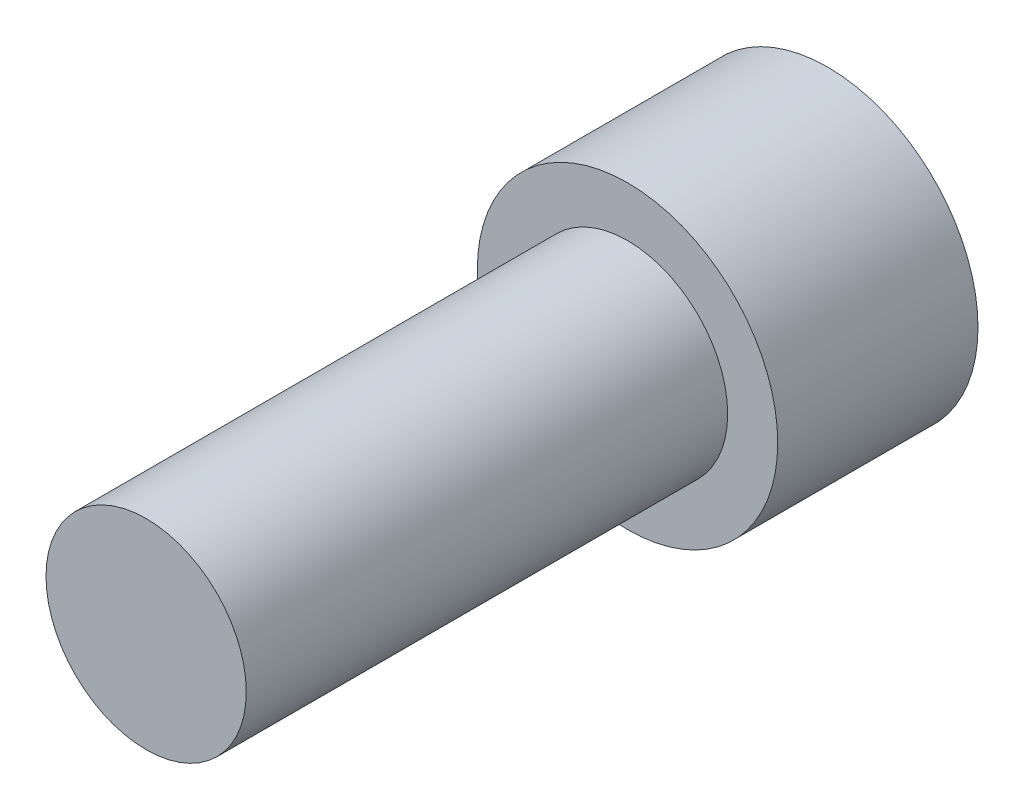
from build123d import *

# Parameters (mm, degrees)
HEX_2_DEPTH = 4.826


with BuildPart() as part:
    # Sketch6 → Revolve1 (revolve)
    with BuildSketch(Plane(origin=(0, 0, 0), x_dir=(0, 0, -1), z_dir=(1, 0, 0)), mode=Mode.PRIVATE) as revolve1_sk:
        Polygon((-19.05, 0), (-19.05, -3.9624), (0, -3.9624), (0, -5.9436), (7.9248, -5.9436), (7.9248, 0), align=None)
    revolve(revolve1_sk.sketch.rotate(Axis((0, 0, 19.05), (0, 0, -1)), 270), axis=Axis((0, 0, 19.05), (0, 0, -1)))

    # Sketch7 → HEX 2 (cut)
    with BuildSketch(Plane(origin=(0, 0, -7.9248), x_dir=(-1, 0, 0), z_dir=(0, 0, -1))):
        Polygon((-3.175, 1.833087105), (-3.175, -1.833087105), (0, -3.666174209), (3.175, -1.833087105), (3.175, 1.833087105), (0, 3.666174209), align=None)
    extrude(amount=-HEX_2_DEPTH, mode=Mode.SUBTRACT)


solid = part.part
